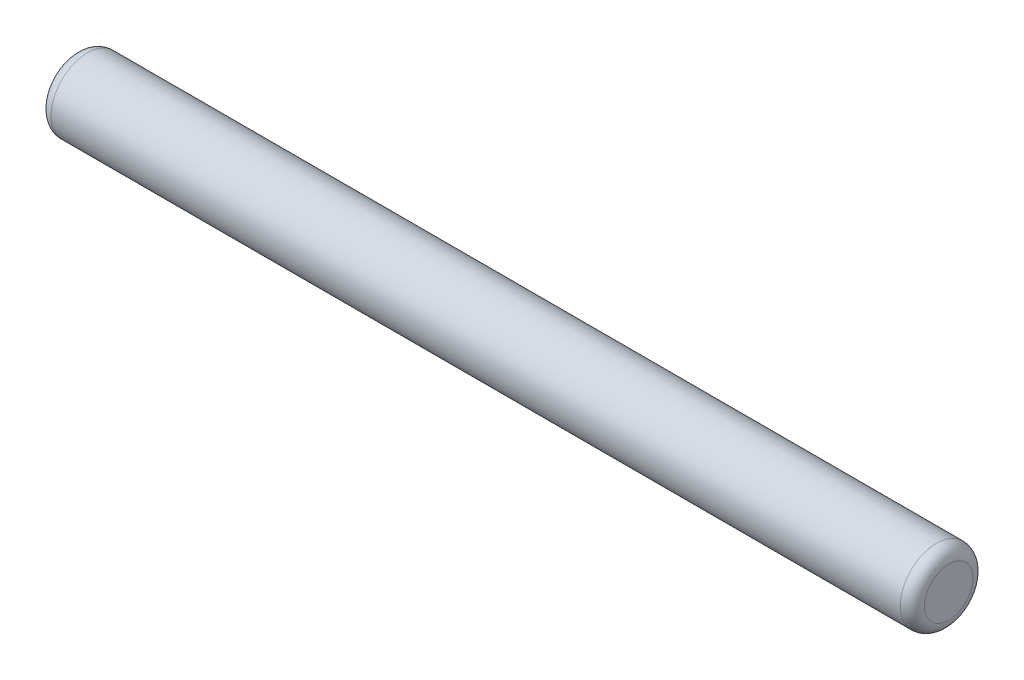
ISO-10303-21;
HEADER;
FILE_DESCRIPTION(('STEP AP214'),'2;1');
FILE_NAME('part.step','',(''),(''),'','','');
FILE_SCHEMA(('AUTOMOTIVE_DESIGN { 1 0 10303 214 1 1 1 1 }'));
ENDSEC;
DATA;
#1=APPLICATION_CONTEXT('core data for automotive mechanical design processes');
#2=APPLICATION_PROTOCOL_DEFINITION('international standard','automotive_design',2000,#1);
#3=PRODUCT_CONTEXT('',#1,'mechanical');
#4=PRODUCT('Part','Part','',(#3));
#5=PRODUCT_RELATED_PRODUCT_CATEGORY('part','',(#4));
#6=PRODUCT_DEFINITION_FORMATION('','',#4);
#7=PRODUCT_DEFINITION_CONTEXT('part definition',#1,'design');
#8=PRODUCT_DEFINITION('design','',#6,#7);
#9=PRODUCT_DEFINITION_SHAPE('','',#8);
#10=(LENGTH_UNIT() NAMED_UNIT(*) SI_UNIT(.MILLI.,.METRE.));
#11=(NAMED_UNIT(*) PLANE_ANGLE_UNIT() SI_UNIT($,.RADIAN.));
#12=(NAMED_UNIT(*) SI_UNIT($,.STERADIAN.) SOLID_ANGLE_UNIT());
#13=UNCERTAINTY_MEASURE_WITH_UNIT(LENGTH_MEASURE(1.E-05),#10,'distance_accuracy_value','');
#14=(GEOMETRIC_REPRESENTATION_CONTEXT(3) GLOBAL_UNCERTAINTY_ASSIGNED_CONTEXT((#13)) GLOBAL_UNIT_ASSIGNED_CONTEXT((#10,
#11,#12)) REPRESENTATION_CONTEXT('',''));
#15=CARTESIAN_POINT('',(0.,0.,0.));
#16=DIRECTION('',(0.,0.,1.));
#17=DIRECTION('',(1.,0.,0.));
#18=AXIS2_PLACEMENT_3D('',#15,#16,#17);
#19=CARTESIAN_POINT('',(0.,0.,0.));
#20=DIRECTION('',(1.,0.,0.));
#21=DIRECTION('',(0.,0.,-1.));
#22=AXIS2_PLACEMENT_3D('',#19,#20,#21);
#23=PLANE('',#22);
#24=CARTESIAN_POINT('',(0.,0.,0.));
#25=DIRECTION('',(1.,0.,0.));
#26=DIRECTION('',(0.,0.,-1.));
#27=AXIS2_PLACEMENT_3D('',#24,#25,#26);
#28=CIRCLE('',#27,1.);
#29=CARTESIAN_POINT('',(0.,0.,-1.));
#30=VERTEX_POINT('',#29);
#31=EDGE_CURVE('E29',#30,#30,#28,.F.);
#32=ORIENTED_EDGE('',*,*,#31,.T.);
#33=EDGE_LOOP('',(#32));
#34=FACE_BOUND('',#33,.T.);
#35=ADVANCED_FACE('F14',(#34),#23,.F.);
#36=CARTESIAN_POINT('',(0.,0.,0.));
#37=DIRECTION('',(-1.,0.,0.));
#38=DIRECTION('',(0.,0.,1.));
#39=AXIS2_PLACEMENT_3D('',#36,#37,#38);
#40=CYLINDRICAL_SURFACE('',#39,1.5);
#41=CARTESIAN_POINT('',(0.5,0.,0.));
#42=DIRECTION('',(1.,0.,0.));
#43=DIRECTION('',(0.,0.,-1.));
#44=AXIS2_PLACEMENT_3D('',#41,#42,#43);
#45=CIRCLE('',#44,1.5);
#46=CARTESIAN_POINT('',(0.5,0.,-1.5));
#47=VERTEX_POINT('',#46);
#48=EDGE_CURVE('E21',#47,#47,#45,.T.);
#49=ORIENTED_EDGE('',*,*,#48,.T.);
#50=EDGE_LOOP('',(#49));
#51=FACE_BOUND('',#50,.T.);
#52=CARTESIAN_POINT('',(35.5,0.,0.));
#53=DIRECTION('',(-1.,0.,0.));
#54=DIRECTION('',(0.,0.,1.));
#55=AXIS2_PLACEMENT_3D('',#52,#53,#54);
#56=CIRCLE('',#55,1.5);
#57=CARTESIAN_POINT('',(35.5,0.,1.5));
#58=VERTEX_POINT('',#57);
#59=EDGE_CURVE('E25',#58,#58,#56,.T.);
#60=ORIENTED_EDGE('',*,*,#59,.T.);
#61=EDGE_LOOP('',(#60));
#62=FACE_BOUND('',#61,.T.);
#63=ADVANCED_FACE('F47',(#51,#62),#40,.T.);
#64=CARTESIAN_POINT('',(36.,1.5,0.));
#65=DIRECTION('',(-1.,0.,0.));
#66=DIRECTION('',(0.,0.,1.));
#67=AXIS2_PLACEMENT_3D('',#64,#65,#66);
#68=PLANE('',#67);
#69=CARTESIAN_POINT('',(36.,0.,0.));
#70=DIRECTION('',(-1.,0.,0.));
#71=DIRECTION('',(0.,0.,1.));
#72=AXIS2_PLACEMENT_3D('',#69,#70,#71);
#73=CIRCLE('',#72,1.);
#74=CARTESIAN_POINT('',(36.,0.,1.));
#75=VERTEX_POINT('',#74);
#76=EDGE_CURVE('E9',#75,#75,#73,.F.);
#77=ORIENTED_EDGE('',*,*,#76,.T.);
#78=EDGE_LOOP('',(#77));
#79=FACE_BOUND('',#78,.T.);
#80=ADVANCED_FACE('F38',(#79),#68,.F.);
#81=CARTESIAN_POINT('',(0.5,0.,0.));
#82=DIRECTION('',(1.,0.,0.));
#83=DIRECTION('',(0.,0.,-1.));
#84=AXIS2_PLACEMENT_3D('',#81,#82,#83);
#85=TOROIDAL_SURFACE('',#84,1.,0.5);
#86=ORIENTED_EDGE('',*,*,#48,.F.);
#87=EDGE_LOOP('',(#86));
#88=FACE_BOUND('',#87,.T.);
#89=ORIENTED_EDGE('',*,*,#31,.F.);
#90=EDGE_LOOP('',(#89));
#91=FACE_BOUND('',#90,.T.);
#92=ADVANCED_FACE('F36',(#88,#91),#85,.T.);
#93=CARTESIAN_POINT('',(35.5,0.,0.));
#94=DIRECTION('',(-1.,0.,0.));
#95=DIRECTION('',(0.,0.,1.));
#96=AXIS2_PLACEMENT_3D('',#93,#94,#95);
#97=TOROIDAL_SURFACE('',#96,1.,0.5);
#98=ORIENTED_EDGE('',*,*,#76,.F.);
#99=EDGE_LOOP('',(#98));
#100=FACE_BOUND('',#99,.T.);
#101=ORIENTED_EDGE('',*,*,#59,.F.);
#102=EDGE_LOOP('',(#101));
#103=FACE_BOUND('',#102,.T.);
#104=ADVANCED_FACE('F16',(#100,#103),#97,.T.);
#105=CLOSED_SHELL('',(#35,#63,#80,#92,#104));
#106=MANIFOLD_SOLID_BREP('B1',#105);
#107=ADVANCED_BREP_SHAPE_REPRESENTATION('',(#18,#106),#14);
#108=SHAPE_DEFINITION_REPRESENTATION(#9,#107);
ENDSEC;
END-ISO-10303-21;
